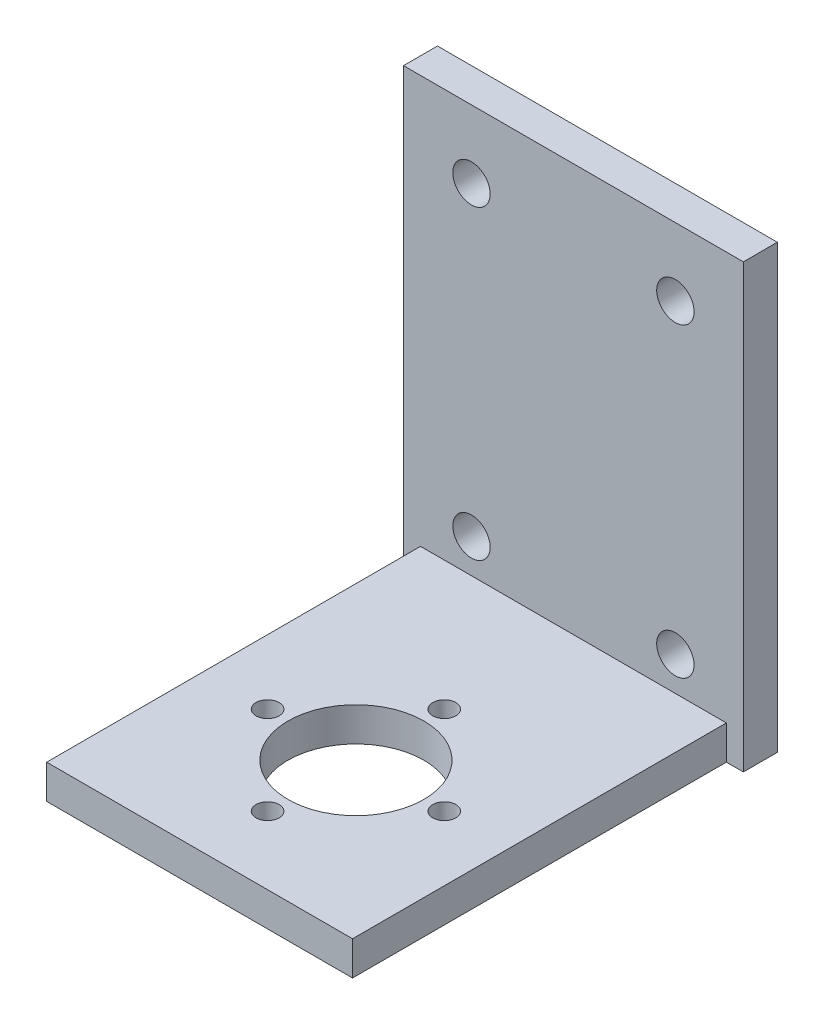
ISO-10303-21;
HEADER;
FILE_DESCRIPTION(('STEP AP214'),'2;1');
FILE_NAME('part.step','',(''),(''),'','','');
FILE_SCHEMA(('AUTOMOTIVE_DESIGN { 1 0 10303 214 1 1 1 1 }'));
ENDSEC;
DATA;
#1=APPLICATION_CONTEXT('core data for automotive mechanical design processes');
#2=APPLICATION_PROTOCOL_DEFINITION('international standard','automotive_design',2000,#1);
#3=PRODUCT_CONTEXT('',#1,'mechanical');
#4=PRODUCT('Part','Part','',(#3));
#5=PRODUCT_RELATED_PRODUCT_CATEGORY('part','',(#4));
#6=PRODUCT_DEFINITION_FORMATION('','',#4);
#7=PRODUCT_DEFINITION_CONTEXT('part definition',#1,'design');
#8=PRODUCT_DEFINITION('design','',#6,#7);
#9=PRODUCT_DEFINITION_SHAPE('','',#8);
#10=(LENGTH_UNIT() NAMED_UNIT(*) SI_UNIT(.MILLI.,.METRE.));
#11=(NAMED_UNIT(*) PLANE_ANGLE_UNIT() SI_UNIT($,.RADIAN.));
#12=(NAMED_UNIT(*) SI_UNIT($,.STERADIAN.) SOLID_ANGLE_UNIT());
#13=UNCERTAINTY_MEASURE_WITH_UNIT(LENGTH_MEASURE(1.E-05),#10,'distance_accuracy_value','');
#14=(GEOMETRIC_REPRESENTATION_CONTEXT(3) GLOBAL_UNCERTAINTY_ASSIGNED_CONTEXT((#13)) GLOBAL_UNIT_ASSIGNED_CONTEXT((#10,
#11,#12)) REPRESENTATION_CONTEXT('',''));
#15=CARTESIAN_POINT('',(0.,0.,0.));
#16=DIRECTION('',(0.,0.,1.));
#17=DIRECTION('',(1.,0.,0.));
#18=AXIS2_PLACEMENT_3D('',#15,#16,#17);
#19=CARTESIAN_POINT('',(0.,0.,5.));
#20=DIRECTION('',(0.,0.,-1.));
#21=DIRECTION('',(-1.,0.,0.));
#22=AXIS2_PLACEMENT_3D('',#19,#20,#21);
#23=PLANE('',#22);
#24=CARTESIAN_POINT('',(15.,22.5,5.));
#25=DIRECTION('',(0.,0.,1.));
#26=DIRECTION('',(1.,0.,0.));
#27=AXIS2_PLACEMENT_3D('',#24,#25,#26);
#28=CIRCLE('',#27,2.75);
#29=CARTESIAN_POINT('',(17.75,22.5,5.));
#30=VERTEX_POINT('',#29);
#31=EDGE_CURVE('E372',#30,#30,#28,.T.);
#32=ORIENTED_EDGE('',*,*,#31,.F.);
#33=EDGE_LOOP('',(#32));
#34=FACE_BOUND('',#33,.T.);
#35=CARTESIAN_POINT('',(-15.,-22.5,5.));
#36=DIRECTION('',(0.,0.,1.));
#37=DIRECTION('',(1.,0.,0.));
#38=AXIS2_PLACEMENT_3D('',#35,#36,#37);
#39=CIRCLE('',#38,2.75);
#40=CARTESIAN_POINT('',(-12.25,-22.5,5.));
#41=VERTEX_POINT('',#40);
#42=EDGE_CURVE('E379',#41,#41,#39,.T.);
#43=ORIENTED_EDGE('',*,*,#42,.F.);
#44=EDGE_LOOP('',(#43));
#45=FACE_BOUND('',#44,.T.);
#46=CARTESIAN_POINT('',(15.,-22.5,5.));
#47=DIRECTION('',(0.,0.,1.));
#48=DIRECTION('',(1.,0.,0.));
#49=AXIS2_PLACEMENT_3D('',#46,#47,#48);
#50=CIRCLE('',#49,2.75);
#51=CARTESIAN_POINT('',(17.75,-22.5,5.));
#52=VERTEX_POINT('',#51);
#53=EDGE_CURVE('E394',#52,#52,#50,.T.);
#54=ORIENTED_EDGE('',*,*,#53,.F.);
#55=EDGE_LOOP('',(#54));
#56=FACE_BOUND('',#55,.T.);
#57=CARTESIAN_POINT('',(-15.,22.5,5.));
#58=DIRECTION('',(0.,0.,1.));
#59=DIRECTION('',(1.,0.,0.));
#60=AXIS2_PLACEMENT_3D('',#57,#58,#59);
#61=CIRCLE('',#60,2.75);
#62=CARTESIAN_POINT('',(-12.25,22.5,5.));
#63=VERTEX_POINT('',#62);
#64=EDGE_CURVE('E374',#63,#63,#61,.T.);
#65=ORIENTED_EDGE('',*,*,#64,.F.);
#66=EDGE_LOOP('',(#65));
#67=FACE_BOUND('',#66,.T.);
#68=DIRECTION('',(0.,-1.,0.));
#69=VECTOR('',#68,1.);
#70=CARTESIAN_POINT('',(-22.5,-32.5,5.));
#71=LINE('',#70,#69);
#72=CARTESIAN_POINT('',(-22.5,-27.5,5.));
#73=VERTEX_POINT('',#72);
#74=CARTESIAN_POINT('',(-22.5,-32.5,5.));
#75=VERTEX_POINT('',#74);
#76=EDGE_CURVE('E57',#73,#75,#71,.T.);
#77=ORIENTED_EDGE('',*,*,#76,.F.);
#78=DIRECTION('',(-1.,0.,0.));
#79=VECTOR('',#78,1.);
#80=CARTESIAN_POINT('',(-22.5,-27.5,5.));
#81=LINE('',#80,#79);
#82=CARTESIAN_POINT('',(22.5,-27.5,5.));
#83=VERTEX_POINT('',#82);
#84=EDGE_CURVE('E124',#83,#73,#81,.T.);
#85=ORIENTED_EDGE('',*,*,#84,.F.);
#86=DIRECTION('',(0.,1.,0.));
#87=VECTOR('',#86,1.);
#88=CARTESIAN_POINT('',(22.5,-27.5,5.));
#89=LINE('',#88,#87);
#90=CARTESIAN_POINT('',(22.5,-32.5,5.));
#91=VERTEX_POINT('',#90);
#92=EDGE_CURVE('E61',#91,#83,#89,.T.);
#93=ORIENTED_EDGE('',*,*,#92,.F.);
#94=DIRECTION('',(1.,0.,0.));
#95=VECTOR('',#94,1.);
#96=CARTESIAN_POINT('',(25.,-32.5,5.));
#97=LINE('',#96,#95);
#98=CARTESIAN_POINT('',(25.,-32.5,5.));
#99=VERTEX_POINT('',#98);
#100=EDGE_CURVE('E141',#91,#99,#97,.T.);
#101=ORIENTED_EDGE('',*,*,#100,.T.);
#102=DIRECTION('',(0.,1.,0.));
#103=VECTOR('',#102,1.);
#104=CARTESIAN_POINT('',(25.,-32.5,5.));
#105=LINE('',#104,#103);
#106=CARTESIAN_POINT('',(25.,32.5,5.));
#107=VERTEX_POINT('',#106);
#108=EDGE_CURVE('E148',#99,#107,#105,.T.);
#109=ORIENTED_EDGE('',*,*,#108,.T.);
#110=DIRECTION('',(-1.,0.,0.));
#111=VECTOR('',#110,1.);
#112=CARTESIAN_POINT('',(25.,32.5,5.));
#113=LINE('',#112,#111);
#114=CARTESIAN_POINT('',(-25.,32.5,5.));
#115=VERTEX_POINT('',#114);
#116=EDGE_CURVE('E140',#107,#115,#113,.T.);
#117=ORIENTED_EDGE('',*,*,#116,.T.);
#118=DIRECTION('',(0.,-1.,0.));
#119=VECTOR('',#118,1.);
#120=CARTESIAN_POINT('',(-25.,-32.5,5.));
#121=LINE('',#120,#119);
#122=CARTESIAN_POINT('',(-25.,-32.5,5.));
#123=VERTEX_POINT('',#122);
#124=EDGE_CURVE('E139',#115,#123,#121,.T.);
#125=ORIENTED_EDGE('',*,*,#124,.T.);
#126=EDGE_CURVE('E145',#123,#75,#97,.T.);
#127=ORIENTED_EDGE('',*,*,#126,.T.);
#128=EDGE_LOOP('',(#77,#85,#93,#101,#109,#117,#125,#127));
#129=FACE_BOUND('',#128,.T.);
#130=ADVANCED_FACE('F39',(#34,#45,#56,#67,#129),#23,.F.);
#131=CARTESIAN_POINT('',(25.,32.5,5.));
#132=DIRECTION('',(0.,-1.,0.));
#133=DIRECTION('',(0.,0.,-1.));
#134=AXIS2_PLACEMENT_3D('',#131,#132,#133);
#135=PLANE('',#134);
#136=DIRECTION('',(-1.,0.,0.));
#137=VECTOR('',#136,1.);
#138=CARTESIAN_POINT('',(25.,32.5,0.));
#139=LINE('',#138,#137);
#140=CARTESIAN_POINT('',(25.,32.5,0.));
#141=VERTEX_POINT('',#140);
#142=CARTESIAN_POINT('',(-25.,32.5,0.));
#143=VERTEX_POINT('',#142);
#144=EDGE_CURVE('E126',#141,#143,#139,.T.);
#145=ORIENTED_EDGE('',*,*,#144,.T.);
#146=DIRECTION('',(0.,0.,-1.));
#147=VECTOR('',#146,1.);
#148=CARTESIAN_POINT('',(-25.,32.5,5.));
#149=LINE('',#148,#147);
#150=EDGE_CURVE('E11',#115,#143,#149,.T.);
#151=ORIENTED_EDGE('',*,*,#150,.F.);
#152=ORIENTED_EDGE('',*,*,#116,.F.);
#153=DIRECTION('',(0.,0.,-1.));
#154=VECTOR('',#153,1.);
#155=CARTESIAN_POINT('',(25.,32.5,5.));
#156=LINE('',#155,#154);
#157=EDGE_CURVE('E150',#107,#141,#156,.T.);
#158=ORIENTED_EDGE('',*,*,#157,.T.);
#159=EDGE_LOOP('',(#145,#151,#152,#158));
#160=FACE_BOUND('',#159,.T.);
#161=ADVANCED_FACE('F41',(#160),#135,.F.);
#162=CARTESIAN_POINT('',(-25.,-32.5,5.));
#163=DIRECTION('',(1.,0.,0.));
#164=DIRECTION('',(0.,0.,-1.));
#165=AXIS2_PLACEMENT_3D('',#162,#163,#164);
#166=PLANE('',#165);
#167=DIRECTION('',(0.,-1.,0.));
#168=VECTOR('',#167,1.);
#169=CARTESIAN_POINT('',(-25.,-32.5,0.));
#170=LINE('',#169,#168);
#171=CARTESIAN_POINT('',(-25.,-32.5,0.));
#172=VERTEX_POINT('',#171);
#173=EDGE_CURVE('E134',#143,#172,#170,.T.);
#174=ORIENTED_EDGE('',*,*,#173,.T.);
#175=DIRECTION('',(0.,0.,-1.));
#176=VECTOR('',#175,1.);
#177=CARTESIAN_POINT('',(-25.,-32.5,5.));
#178=LINE('',#177,#176);
#179=EDGE_CURVE('E48',#123,#172,#178,.T.);
#180=ORIENTED_EDGE('',*,*,#179,.F.);
#181=ORIENTED_EDGE('',*,*,#124,.F.);
#182=ORIENTED_EDGE('',*,*,#150,.T.);
#183=EDGE_LOOP('',(#174,#180,#181,#182));
#184=FACE_BOUND('',#183,.T.);
#185=ADVANCED_FACE('F214',(#184),#166,.F.);
#186=CARTESIAN_POINT('',(25.,-32.5,5.));
#187=DIRECTION('',(0.,1.,0.));
#188=DIRECTION('',(0.,0.,1.));
#189=AXIS2_PLACEMENT_3D('',#186,#187,#188);
#190=PLANE('',#189);
#191=CARTESIAN_POINT('',(0.,-32.5,50.));
#192=DIRECTION('',(0.,-1.,0.));
#193=DIRECTION('',(0.,0.,-1.));
#194=AXIS2_PLACEMENT_3D('',#191,#192,#193);
#195=CIRCLE('',#194,1.7);
#196=CARTESIAN_POINT('',(0.,-32.5,48.3));
#197=VERTEX_POINT('',#196);
#198=EDGE_CURVE('E169',#197,#197,#195,.T.);
#199=ORIENTED_EDGE('',*,*,#198,.F.);
#200=EDGE_LOOP('',(#199));
#201=FACE_BOUND('',#200,.T.);
#202=CARTESIAN_POINT('',(13.,-32.5,37.));
#203=DIRECTION('',(0.,-1.,0.));
#204=DIRECTION('',(0.,0.,-1.));
#205=AXIS2_PLACEMENT_3D('',#202,#203,#204);
#206=CIRCLE('',#205,1.7);
#207=CARTESIAN_POINT('',(13.,-32.5,35.3));
#208=VERTEX_POINT('',#207);
#209=EDGE_CURVE('E398',#208,#208,#206,.T.);
#210=ORIENTED_EDGE('',*,*,#209,.F.);
#211=EDGE_LOOP('',(#210));
#212=FACE_BOUND('',#211,.T.);
#213=CARTESIAN_POINT('',(0.,-32.5,24.));
#214=DIRECTION('',(0.,-1.,0.));
#215=DIRECTION('',(0.,0.,-1.));
#216=AXIS2_PLACEMENT_3D('',#213,#214,#215);
#217=CIRCLE('',#216,1.7);
#218=CARTESIAN_POINT('',(0.,-32.5,22.3));
#219=VERTEX_POINT('',#218);
#220=EDGE_CURVE('E396',#219,#219,#217,.T.);
#221=ORIENTED_EDGE('',*,*,#220,.F.);
#222=EDGE_LOOP('',(#221));
#223=FACE_BOUND('',#222,.T.);
#224=CARTESIAN_POINT('',(-13.,-32.5,37.));
#225=DIRECTION('',(0.,-1.,0.));
#226=DIRECTION('',(0.,0.,-1.));
#227=AXIS2_PLACEMENT_3D('',#224,#225,#226);
#228=CIRCLE('',#227,1.7);
#229=CARTESIAN_POINT('',(-13.,-32.5,35.3));
#230=VERTEX_POINT('',#229);
#231=EDGE_CURVE('E185',#230,#230,#228,.T.);
#232=ORIENTED_EDGE('',*,*,#231,.F.);
#233=EDGE_LOOP('',(#232));
#234=FACE_BOUND('',#233,.T.);
#235=CARTESIAN_POINT('',(0.,-32.5,37.));
#236=DIRECTION('',(0.,-1.,0.));
#237=DIRECTION('',(0.,0.,-1.));
#238=AXIS2_PLACEMENT_3D('',#235,#236,#237);
#239=CIRCLE('',#238,10.);
#240=CARTESIAN_POINT('',(0.,-32.5,27.));
#241=VERTEX_POINT('',#240);
#242=EDGE_CURVE('E162',#241,#241,#239,.T.);
#243=ORIENTED_EDGE('',*,*,#242,.F.);
#244=EDGE_LOOP('',(#243));
#245=FACE_BOUND('',#244,.T.);
#246=DIRECTION('',(1.,0.,0.));
#247=VECTOR('',#246,1.);
#248=CARTESIAN_POINT('',(25.,-32.5,0.));
#249=LINE('',#248,#247);
#250=CARTESIAN_POINT('',(25.,-32.5,0.));
#251=VERTEX_POINT('',#250);
#252=EDGE_CURVE('E147',#172,#251,#249,.T.);
#253=ORIENTED_EDGE('',*,*,#252,.T.);
#254=DIRECTION('',(0.,0.,-1.));
#255=VECTOR('',#254,1.);
#256=CARTESIAN_POINT('',(25.,-32.5,5.));
#257=LINE('',#256,#255);
#258=EDGE_CURVE('E154',#99,#251,#257,.T.);
#259=ORIENTED_EDGE('',*,*,#258,.F.);
#260=ORIENTED_EDGE('',*,*,#100,.F.);
#261=DIRECTION('',(0.,0.,-1.));
#262=VECTOR('',#261,1.);
#263=CARTESIAN_POINT('',(22.5,-32.5,60.));
#264=LINE('',#263,#262);
#265=CARTESIAN_POINT('',(22.5,-32.5,60.));
#266=VERTEX_POINT('',#265);
#267=EDGE_CURVE('E115',#266,#91,#264,.T.);
#268=ORIENTED_EDGE('',*,*,#267,.F.);
#269=DIRECTION('',(1.,0.,0.));
#270=VECTOR('',#269,1.);
#271=CARTESIAN_POINT('',(0.,-32.5,60.));
#272=LINE('',#271,#270);
#273=CARTESIAN_POINT('',(-22.5,-32.5,60.));
#274=VERTEX_POINT('',#273);
#275=EDGE_CURVE('E104',#274,#266,#272,.T.);
#276=ORIENTED_EDGE('',*,*,#275,.F.);
#277=DIRECTION('',(0.,0.,-1.));
#278=VECTOR('',#277,1.);
#279=CARTESIAN_POINT('',(-22.5,-32.5,60.));
#280=LINE('',#279,#278);
#281=EDGE_CURVE('E109',#274,#75,#280,.T.);
#282=ORIENTED_EDGE('',*,*,#281,.T.);
#283=ORIENTED_EDGE('',*,*,#126,.F.);
#284=ORIENTED_EDGE('',*,*,#179,.T.);
#285=EDGE_LOOP('',(#253,#259,#260,#268,#276,#282,#283,#284));
#286=FACE_BOUND('',#285,.T.);
#287=ADVANCED_FACE('F110',(#201,#212,#223,#234,#245,#286),#190,.F.);
#288=CARTESIAN_POINT('',(25.,-32.5,5.));
#289=DIRECTION('',(-1.,0.,0.));
#290=DIRECTION('',(0.,0.,1.));
#291=AXIS2_PLACEMENT_3D('',#288,#289,#290);
#292=PLANE('',#291);
#293=DIRECTION('',(0.,1.,0.));
#294=VECTOR('',#293,1.);
#295=CARTESIAN_POINT('',(25.,-32.5,0.));
#296=LINE('',#295,#294);
#297=EDGE_CURVE('E143',#251,#141,#296,.T.);
#298=ORIENTED_EDGE('',*,*,#297,.T.);
#299=ORIENTED_EDGE('',*,*,#157,.F.);
#300=ORIENTED_EDGE('',*,*,#108,.F.);
#301=ORIENTED_EDGE('',*,*,#258,.T.);
#302=EDGE_LOOP('',(#298,#299,#300,#301));
#303=FACE_BOUND('',#302,.T.);
#304=ADVANCED_FACE('F222',(#303),#292,.F.);
#305=CARTESIAN_POINT('',(0.,0.,0.));
#306=DIRECTION('',(0.,0.,-1.));
#307=DIRECTION('',(-1.,0.,0.));
#308=AXIS2_PLACEMENT_3D('',#305,#306,#307);
#309=PLANE('',#308);
#310=CARTESIAN_POINT('',(15.,22.5,0.));
#311=DIRECTION('',(0.,0.,1.));
#312=DIRECTION('',(1.,0.,0.));
#313=AXIS2_PLACEMENT_3D('',#310,#311,#312);
#314=CIRCLE('',#313,2.75);
#315=CARTESIAN_POINT('',(17.75,22.5,0.));
#316=VERTEX_POINT('',#315);
#317=EDGE_CURVE('E375',#316,#316,#314,.T.);
#318=ORIENTED_EDGE('',*,*,#317,.T.);
#319=EDGE_LOOP('',(#318));
#320=FACE_BOUND('',#319,.T.);
#321=CARTESIAN_POINT('',(-15.,-22.5,0.));
#322=DIRECTION('',(0.,0.,1.));
#323=DIRECTION('',(1.,0.,0.));
#324=AXIS2_PLACEMENT_3D('',#321,#322,#323);
#325=CIRCLE('',#324,2.75);
#326=CARTESIAN_POINT('',(-12.25,-22.5,0.));
#327=VERTEX_POINT('',#326);
#328=EDGE_CURVE('E389',#327,#327,#325,.T.);
#329=ORIENTED_EDGE('',*,*,#328,.T.);
#330=EDGE_LOOP('',(#329));
#331=FACE_BOUND('',#330,.T.);
#332=CARTESIAN_POINT('',(15.,-22.5,0.));
#333=DIRECTION('',(0.,0.,1.));
#334=DIRECTION('',(1.,0.,0.));
#335=AXIS2_PLACEMENT_3D('',#332,#333,#334);
#336=CIRCLE('',#335,2.75);
#337=CARTESIAN_POINT('',(17.75,-22.5,0.));
#338=VERTEX_POINT('',#337);
#339=EDGE_CURVE('E382',#338,#338,#336,.T.);
#340=ORIENTED_EDGE('',*,*,#339,.T.);
#341=EDGE_LOOP('',(#340));
#342=FACE_BOUND('',#341,.T.);
#343=CARTESIAN_POINT('',(-15.,22.5,0.));
#344=DIRECTION('',(0.,0.,1.));
#345=DIRECTION('',(1.,0.,0.));
#346=AXIS2_PLACEMENT_3D('',#343,#344,#345);
#347=CIRCLE('',#346,2.75);
#348=CARTESIAN_POINT('',(-12.25,22.5,0.));
#349=VERTEX_POINT('',#348);
#350=EDGE_CURVE('E378',#349,#349,#347,.T.);
#351=ORIENTED_EDGE('',*,*,#350,.T.);
#352=EDGE_LOOP('',(#351));
#353=FACE_BOUND('',#352,.T.);
#354=ORIENTED_EDGE('',*,*,#144,.F.);
#355=ORIENTED_EDGE('',*,*,#297,.F.);
#356=ORIENTED_EDGE('',*,*,#252,.F.);
#357=ORIENTED_EDGE('',*,*,#173,.F.);
#358=EDGE_LOOP('',(#354,#355,#356,#357));
#359=FACE_BOUND('',#358,.T.);
#360=ADVANCED_FACE('F202',(#320,#331,#342,#353,#359),#309,.T.);
#361=CARTESIAN_POINT('',(-22.5,-32.5,60.));
#362=DIRECTION('',(1.,0.,0.));
#363=DIRECTION('',(0.,0.,-1.));
#364=AXIS2_PLACEMENT_3D('',#361,#362,#363);
#365=PLANE('',#364);
#366=ORIENTED_EDGE('',*,*,#76,.T.);
#367=ORIENTED_EDGE('',*,*,#281,.F.);
#368=DIRECTION('',(0.,-1.,0.));
#369=VECTOR('',#368,1.);
#370=CARTESIAN_POINT('',(-22.5,-32.5,60.));
#371=LINE('',#370,#369);
#372=CARTESIAN_POINT('',(-22.5,-27.5,60.));
#373=VERTEX_POINT('',#372);
#374=EDGE_CURVE('E119',#373,#274,#371,.T.);
#375=ORIENTED_EDGE('',*,*,#374,.F.);
#376=DIRECTION('',(0.,0.,-1.));
#377=VECTOR('',#376,1.);
#378=CARTESIAN_POINT('',(-22.5,-27.5,60.));
#379=LINE('',#378,#377);
#380=EDGE_CURVE('E186',#373,#73,#379,.T.);
#381=ORIENTED_EDGE('',*,*,#380,.T.);
#382=EDGE_LOOP('',(#366,#367,#375,#381));
#383=FACE_BOUND('',#382,.T.);
#384=ADVANCED_FACE('F130',(#383),#365,.F.);
#385=CARTESIAN_POINT('',(22.5,-27.5,60.));
#386=DIRECTION('',(-1.,0.,0.));
#387=DIRECTION('',(0.,0.,1.));
#388=AXIS2_PLACEMENT_3D('',#385,#386,#387);
#389=PLANE('',#388);
#390=ORIENTED_EDGE('',*,*,#92,.T.);
#391=DIRECTION('',(0.,0.,-1.));
#392=VECTOR('',#391,1.);
#393=CARTESIAN_POINT('',(22.5,-27.5,60.));
#394=LINE('',#393,#392);
#395=CARTESIAN_POINT('',(22.5,-27.5,60.));
#396=VERTEX_POINT('',#395);
#397=EDGE_CURVE('E135',#396,#83,#394,.T.);
#398=ORIENTED_EDGE('',*,*,#397,.F.);
#399=DIRECTION('',(0.,1.,0.));
#400=VECTOR('',#399,1.);
#401=CARTESIAN_POINT('',(22.5,-27.5,60.));
#402=LINE('',#401,#400);
#403=EDGE_CURVE('E113',#266,#396,#402,.T.);
#404=ORIENTED_EDGE('',*,*,#403,.F.);
#405=ORIENTED_EDGE('',*,*,#267,.T.);
#406=EDGE_LOOP('',(#390,#398,#404,#405));
#407=FACE_BOUND('',#406,.T.);
#408=ADVANCED_FACE('F198',(#407),#389,.F.);
#409=CARTESIAN_POINT('',(-22.5,-27.5,60.));
#410=DIRECTION('',(0.,-1.,0.));
#411=DIRECTION('',(0.,0.,-1.));
#412=AXIS2_PLACEMENT_3D('',#409,#410,#411);
#413=PLANE('',#412);
#414=CARTESIAN_POINT('',(0.,-27.5,50.));
#415=DIRECTION('',(0.,-1.,0.));
#416=DIRECTION('',(0.,0.,-1.));
#417=AXIS2_PLACEMENT_3D('',#414,#415,#416);
#418=CIRCLE('',#417,1.7);
#419=CARTESIAN_POINT('',(0.,-27.5,48.3));
#420=VERTEX_POINT('',#419);
#421=EDGE_CURVE('E43',#420,#420,#418,.T.);
#422=ORIENTED_EDGE('',*,*,#421,.T.);
#423=EDGE_LOOP('',(#422));
#424=FACE_BOUND('',#423,.T.);
#425=CARTESIAN_POINT('',(13.,-27.5,37.));
#426=DIRECTION('',(0.,-1.,0.));
#427=DIRECTION('',(0.,0.,-1.));
#428=AXIS2_PLACEMENT_3D('',#425,#426,#427);
#429=CIRCLE('',#428,1.7);
#430=CARTESIAN_POINT('',(13.,-27.5,35.3));
#431=VERTEX_POINT('',#430);
#432=EDGE_CURVE('E168',#431,#431,#429,.T.);
#433=ORIENTED_EDGE('',*,*,#432,.T.);
#434=EDGE_LOOP('',(#433));
#435=FACE_BOUND('',#434,.T.);
#436=CARTESIAN_POINT('',(0.,-27.5,24.));
#437=DIRECTION('',(0.,-1.,0.));
#438=DIRECTION('',(0.,0.,-1.));
#439=AXIS2_PLACEMENT_3D('',#436,#437,#438);
#440=CIRCLE('',#439,1.7);
#441=CARTESIAN_POINT('',(0.,-27.5,22.3));
#442=VERTEX_POINT('',#441);
#443=EDGE_CURVE('E170',#442,#442,#440,.T.);
#444=ORIENTED_EDGE('',*,*,#443,.T.);
#445=EDGE_LOOP('',(#444));
#446=FACE_BOUND('',#445,.T.);
#447=CARTESIAN_POINT('',(-13.,-27.5,37.));
#448=DIRECTION('',(0.,-1.,0.));
#449=DIRECTION('',(0.,0.,-1.));
#450=AXIS2_PLACEMENT_3D('',#447,#448,#449);
#451=CIRCLE('',#450,1.7);
#452=CARTESIAN_POINT('',(-13.,-27.5,35.3));
#453=VERTEX_POINT('',#452);
#454=EDGE_CURVE('E163',#453,#453,#451,.T.);
#455=ORIENTED_EDGE('',*,*,#454,.T.);
#456=EDGE_LOOP('',(#455));
#457=FACE_BOUND('',#456,.T.);
#458=CARTESIAN_POINT('',(0.,-27.5,37.));
#459=DIRECTION('',(0.,-1.,0.));
#460=DIRECTION('',(0.,0.,-1.));
#461=AXIS2_PLACEMENT_3D('',#458,#459,#460);
#462=CIRCLE('',#461,10.);
#463=CARTESIAN_POINT('',(0.,-27.5,27.));
#464=VERTEX_POINT('',#463);
#465=EDGE_CURVE('E159',#464,#464,#462,.T.);
#466=ORIENTED_EDGE('',*,*,#465,.T.);
#467=EDGE_LOOP('',(#466));
#468=FACE_BOUND('',#467,.T.);
#469=ORIENTED_EDGE('',*,*,#84,.T.);
#470=ORIENTED_EDGE('',*,*,#380,.F.);
#471=DIRECTION('',(-1.,0.,0.));
#472=VECTOR('',#471,1.);
#473=CARTESIAN_POINT('',(-22.5,-27.5,60.));
#474=LINE('',#473,#472);
#475=EDGE_CURVE('E123',#396,#373,#474,.T.);
#476=ORIENTED_EDGE('',*,*,#475,.F.);
#477=ORIENTED_EDGE('',*,*,#397,.T.);
#478=EDGE_LOOP('',(#469,#470,#476,#477));
#479=FACE_BOUND('',#478,.T.);
#480=ADVANCED_FACE('F192',(#424,#435,#446,#457,#468,#479),#413,.F.);
#481=CARTESIAN_POINT('',(0.,0.,60.));
#482=DIRECTION('',(0.,0.,-1.));
#483=DIRECTION('',(-1.,0.,0.));
#484=AXIS2_PLACEMENT_3D('',#481,#482,#483);
#485=PLANE('',#484);
#486=ORIENTED_EDGE('',*,*,#374,.T.);
#487=ORIENTED_EDGE('',*,*,#275,.T.);
#488=ORIENTED_EDGE('',*,*,#403,.T.);
#489=ORIENTED_EDGE('',*,*,#475,.T.);
#490=EDGE_LOOP('',(#486,#487,#488,#489));
#491=FACE_BOUND('',#490,.T.);
#492=ADVANCED_FACE('F118',(#491),#485,.F.);
#493=CARTESIAN_POINT('',(0.,32.5,37.));
#494=DIRECTION('',(0.,-1.,0.));
#495=DIRECTION('',(0.,0.,-1.));
#496=AXIS2_PLACEMENT_3D('',#493,#494,#495);
#497=CYLINDRICAL_SURFACE('',#496,10.);
#498=ORIENTED_EDGE('',*,*,#242,.T.);
#499=EDGE_LOOP('',(#498));
#500=FACE_BOUND('',#499,.T.);
#501=ORIENTED_EDGE('',*,*,#465,.F.);
#502=EDGE_LOOP('',(#501));
#503=FACE_BOUND('',#502,.T.);
#504=ADVANCED_FACE('F278',(#500,#503),#497,.F.);
#505=CARTESIAN_POINT('',(-13.,32.5,37.));
#506=DIRECTION('',(0.,-1.,0.));
#507=DIRECTION('',(0.,0.,-1.));
#508=AXIS2_PLACEMENT_3D('',#505,#506,#507);
#509=CYLINDRICAL_SURFACE('',#508,1.7);
#510=ORIENTED_EDGE('',*,*,#231,.T.);
#511=EDGE_LOOP('',(#510));
#512=FACE_BOUND('',#511,.T.);
#513=ORIENTED_EDGE('',*,*,#454,.F.);
#514=EDGE_LOOP('',(#513));
#515=FACE_BOUND('',#514,.T.);
#516=ADVANCED_FACE('F287',(#512,#515),#509,.F.);
#517=CARTESIAN_POINT('',(0.,32.5,24.));
#518=DIRECTION('',(0.,-1.,0.));
#519=DIRECTION('',(0.,0.,-1.));
#520=AXIS2_PLACEMENT_3D('',#517,#518,#519);
#521=CYLINDRICAL_SURFACE('',#520,1.7);
#522=ORIENTED_EDGE('',*,*,#220,.T.);
#523=EDGE_LOOP('',(#522));
#524=FACE_BOUND('',#523,.T.);
#525=ORIENTED_EDGE('',*,*,#443,.F.);
#526=EDGE_LOOP('',(#525));
#527=FACE_BOUND('',#526,.T.);
#528=ADVANCED_FACE('F296',(#524,#527),#521,.F.);
#529=CARTESIAN_POINT('',(13.,32.5,37.));
#530=DIRECTION('',(0.,-1.,0.));
#531=DIRECTION('',(0.,0.,-1.));
#532=AXIS2_PLACEMENT_3D('',#529,#530,#531);
#533=CYLINDRICAL_SURFACE('',#532,1.7);
#534=ORIENTED_EDGE('',*,*,#209,.T.);
#535=EDGE_LOOP('',(#534));
#536=FACE_BOUND('',#535,.T.);
#537=ORIENTED_EDGE('',*,*,#432,.F.);
#538=EDGE_LOOP('',(#537));
#539=FACE_BOUND('',#538,.T.);
#540=ADVANCED_FACE('F307',(#536,#539),#533,.F.);
#541=CARTESIAN_POINT('',(0.,32.5,50.));
#542=DIRECTION('',(0.,-1.,0.));
#543=DIRECTION('',(0.,0.,-1.));
#544=AXIS2_PLACEMENT_3D('',#541,#542,#543);
#545=CYLINDRICAL_SURFACE('',#544,1.7);
#546=ORIENTED_EDGE('',*,*,#198,.T.);
#547=EDGE_LOOP('',(#546));
#548=FACE_BOUND('',#547,.T.);
#549=ORIENTED_EDGE('',*,*,#421,.F.);
#550=EDGE_LOOP('',(#549));
#551=FACE_BOUND('',#550,.T.);
#552=ADVANCED_FACE('F320',(#548,#551),#545,.F.);
#553=CARTESIAN_POINT('',(-15.,22.5,0.));
#554=DIRECTION('',(0.,0.,1.));
#555=DIRECTION('',(1.,0.,0.));
#556=AXIS2_PLACEMENT_3D('',#553,#554,#555);
#557=CYLINDRICAL_SURFACE('',#556,2.75);
#558=ORIENTED_EDGE('',*,*,#350,.F.);
#559=EDGE_LOOP('',(#558));
#560=FACE_BOUND('',#559,.T.);
#561=ORIENTED_EDGE('',*,*,#64,.T.);
#562=EDGE_LOOP('',(#561));
#563=FACE_BOUND('',#562,.T.);
#564=ADVANCED_FACE('F326',(#560,#563),#557,.F.);
#565=CARTESIAN_POINT('',(15.,-22.5,0.));
#566=DIRECTION('',(0.,0.,1.));
#567=DIRECTION('',(1.,0.,0.));
#568=AXIS2_PLACEMENT_3D('',#565,#566,#567);
#569=CYLINDRICAL_SURFACE('',#568,2.75);
#570=ORIENTED_EDGE('',*,*,#339,.F.);
#571=EDGE_LOOP('',(#570));
#572=FACE_BOUND('',#571,.T.);
#573=ORIENTED_EDGE('',*,*,#53,.T.);
#574=EDGE_LOOP('',(#573));
#575=FACE_BOUND('',#574,.T.);
#576=ADVANCED_FACE('F339',(#572,#575),#569,.F.);
#577=CARTESIAN_POINT('',(-15.,-22.5,0.));
#578=DIRECTION('',(0.,0.,1.));
#579=DIRECTION('',(1.,0.,0.));
#580=AXIS2_PLACEMENT_3D('',#577,#578,#579);
#581=CYLINDRICAL_SURFACE('',#580,2.75);
#582=ORIENTED_EDGE('',*,*,#328,.F.);
#583=EDGE_LOOP('',(#582));
#584=FACE_BOUND('',#583,.T.);
#585=ORIENTED_EDGE('',*,*,#42,.T.);
#586=EDGE_LOOP('',(#585));
#587=FACE_BOUND('',#586,.T.);
#588=ADVANCED_FACE('F347',(#584,#587),#581,.F.);
#589=CARTESIAN_POINT('',(15.,22.5,0.));
#590=DIRECTION('',(0.,0.,1.));
#591=DIRECTION('',(1.,0.,0.));
#592=AXIS2_PLACEMENT_3D('',#589,#590,#591);
#593=CYLINDRICAL_SURFACE('',#592,2.75);
#594=ORIENTED_EDGE('',*,*,#317,.F.);
#595=EDGE_LOOP('',(#594));
#596=FACE_BOUND('',#595,.T.);
#597=ORIENTED_EDGE('',*,*,#31,.T.);
#598=EDGE_LOOP('',(#597));
#599=FACE_BOUND('',#598,.T.);
#600=ADVANCED_FACE('F358',(#596,#599),#593,.F.);
#601=CLOSED_SHELL('',(#130,#161,#185,#287,#304,#360,#384,#408,#480,#492,#504,#516,#528,#540,
#552,#564,#576,#588,#600));
#602=MANIFOLD_SOLID_BREP('B2',#601);
#603=ADVANCED_BREP_SHAPE_REPRESENTATION('',(#18,#602),#14);
#604=SHAPE_DEFINITION_REPRESENTATION(#9,#603);
ENDSEC;
END-ISO-10303-21;
